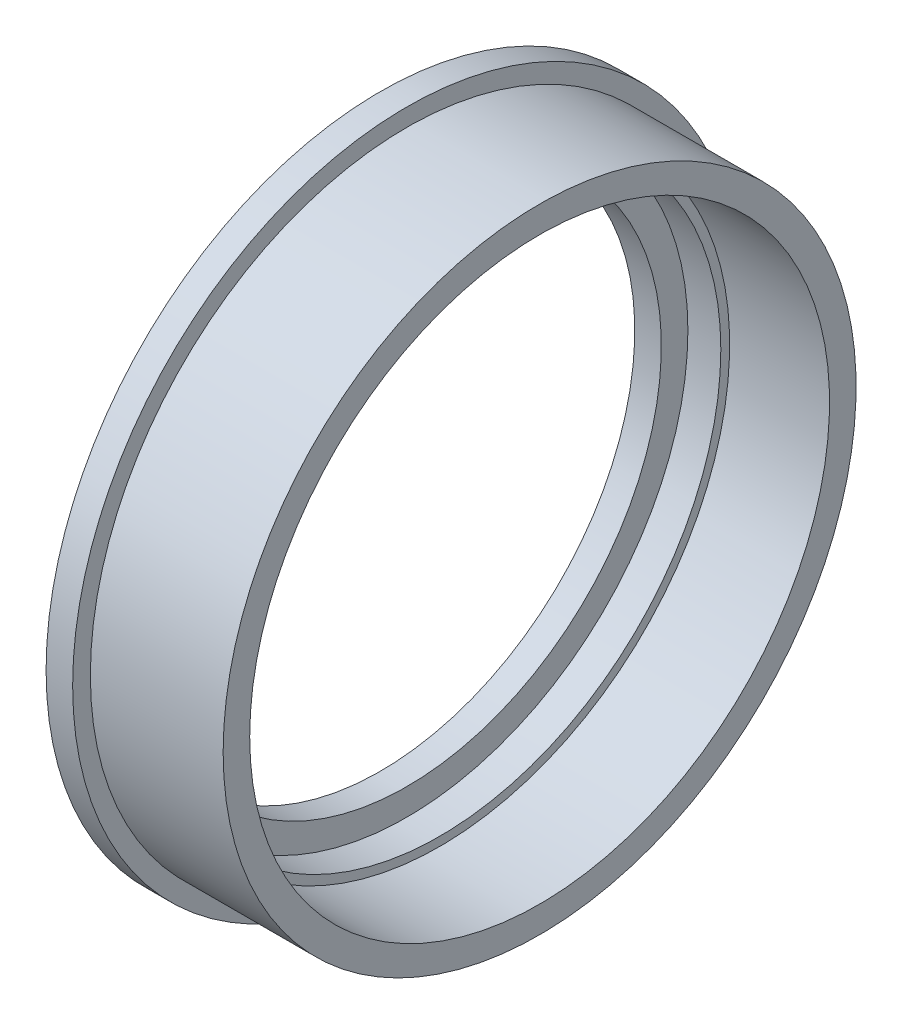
ISO-10303-21;
HEADER;
FILE_DESCRIPTION(('STEP AP214'),'2;1');
FILE_NAME('part.step','',(''),(''),'','','');
FILE_SCHEMA(('AUTOMOTIVE_DESIGN { 1 0 10303 214 1 1 1 1 }'));
ENDSEC;
DATA;
#1=APPLICATION_CONTEXT('core data for automotive mechanical design processes');
#2=APPLICATION_PROTOCOL_DEFINITION('international standard','automotive_design',2000,#1);
#3=PRODUCT_CONTEXT('',#1,'mechanical');
#4=PRODUCT('Part','Part','',(#3));
#5=PRODUCT_RELATED_PRODUCT_CATEGORY('part','',(#4));
#6=PRODUCT_DEFINITION_FORMATION('','',#4);
#7=PRODUCT_DEFINITION_CONTEXT('part definition',#1,'design');
#8=PRODUCT_DEFINITION('design','',#6,#7);
#9=PRODUCT_DEFINITION_SHAPE('','',#8);
#10=(LENGTH_UNIT() NAMED_UNIT(*) SI_UNIT(.MILLI.,.METRE.));
#11=(NAMED_UNIT(*) PLANE_ANGLE_UNIT() SI_UNIT($,.RADIAN.));
#12=(NAMED_UNIT(*) SI_UNIT($,.STERADIAN.) SOLID_ANGLE_UNIT());
#13=UNCERTAINTY_MEASURE_WITH_UNIT(LENGTH_MEASURE(1.E-05),#10,'distance_accuracy_value','');
#14=(GEOMETRIC_REPRESENTATION_CONTEXT(3) GLOBAL_UNCERTAINTY_ASSIGNED_CONTEXT((#13)) GLOBAL_UNIT_ASSIGNED_CONTEXT((#10,
#11,#12)) REPRESENTATION_CONTEXT('',''));
#15=CARTESIAN_POINT('',(0.,0.,0.));
#16=DIRECTION('',(0.,0.,1.));
#17=DIRECTION('',(1.,0.,0.));
#18=AXIS2_PLACEMENT_3D('',#15,#16,#17);
#19=CARTESIAN_POINT('',(0.,31.75,0.));
#20=DIRECTION('',(-1.,0.,0.));
#21=DIRECTION('',(0.,0.,1.));
#22=AXIS2_PLACEMENT_3D('',#19,#20,#21);
#23=PLANE('',#22);
#24=CARTESIAN_POINT('',(0.,0.,0.));
#25=DIRECTION('',(-1.,0.,0.));
#26=DIRECTION('',(0.,0.,1.));
#27=AXIS2_PLACEMENT_3D('',#24,#25,#26);
#28=CIRCLE('',#27,31.75);
#29=CARTESIAN_POINT('',(0.,0.,31.75));
#30=VERTEX_POINT('',#29);
#31=EDGE_CURVE('E62',#30,#30,#28,.T.);
#32=ORIENTED_EDGE('',*,*,#31,.F.);
#33=EDGE_LOOP('',(#32));
#34=FACE_BOUND('',#33,.T.);
#35=CARTESIAN_POINT('',(0.,0.,0.));
#36=DIRECTION('',(-1.,0.,0.));
#37=DIRECTION('',(0.,0.,1.));
#38=AXIS2_PLACEMENT_3D('',#35,#36,#37);
#39=CIRCLE('',#38,28.75);
#40=CARTESIAN_POINT('',(0.,0.,28.75));
#41=VERTEX_POINT('',#40);
#42=EDGE_CURVE('E10',#41,#41,#39,.T.);
#43=ORIENTED_EDGE('',*,*,#42,.T.);
#44=EDGE_LOOP('',(#43));
#45=FACE_BOUND('',#44,.T.);
#46=ADVANCED_FACE('F28',(#34,#45),#23,.F.);
#47=CARTESIAN_POINT('',(0.,0.,0.));
#48=DIRECTION('',(-1.,0.,0.));
#49=DIRECTION('',(0.,0.,1.));
#50=AXIS2_PLACEMENT_3D('',#47,#48,#49);
#51=CYLINDRICAL_SURFACE('',#50,28.75);
#52=ORIENTED_EDGE('',*,*,#42,.F.);
#53=EDGE_LOOP('',(#52));
#54=FACE_BOUND('',#53,.T.);
#55=CARTESIAN_POINT('',(-3.,0.,0.));
#56=DIRECTION('',(-1.,0.,0.));
#57=DIRECTION('',(0.,0.,1.));
#58=AXIS2_PLACEMENT_3D('',#55,#56,#57);
#59=CIRCLE('',#58,28.75);
#60=CARTESIAN_POINT('',(-3.,0.,28.75));
#61=VERTEX_POINT('',#60);
#62=EDGE_CURVE('E34',#61,#61,#59,.T.);
#63=ORIENTED_EDGE('',*,*,#62,.T.);
#64=EDGE_LOOP('',(#63));
#65=FACE_BOUND('',#64,.T.);
#66=ADVANCED_FACE('F69',(#54,#65),#51,.F.);
#67=CARTESIAN_POINT('',(-3.,28.75,0.));
#68=DIRECTION('',(1.,0.,0.));
#69=DIRECTION('',(0.,0.,-1.));
#70=AXIS2_PLACEMENT_3D('',#67,#68,#69);
#71=PLANE('',#70);
#72=ORIENTED_EDGE('',*,*,#62,.F.);
#73=EDGE_LOOP('',(#72));
#74=FACE_BOUND('',#73,.T.);
#75=CARTESIAN_POINT('',(-3.,0.,0.));
#76=DIRECTION('',(-1.,0.,0.));
#77=DIRECTION('',(0.,0.,1.));
#78=AXIS2_PLACEMENT_3D('',#75,#76,#77);
#79=CIRCLE('',#78,37.75);
#80=CARTESIAN_POINT('',(-3.,0.,37.75));
#81=VERTEX_POINT('',#80);
#82=EDGE_CURVE('E38',#81,#81,#79,.T.);
#83=ORIENTED_EDGE('',*,*,#82,.T.);
#84=EDGE_LOOP('',(#83));
#85=FACE_BOUND('',#84,.T.);
#86=ADVANCED_FACE('F73',(#74,#85),#71,.F.);
#87=CARTESIAN_POINT('',(0.,0.,0.));
#88=DIRECTION('',(-1.,0.,0.));
#89=DIRECTION('',(0.,0.,1.));
#90=AXIS2_PLACEMENT_3D('',#87,#88,#89);
#91=CYLINDRICAL_SURFACE('',#90,37.75);
#92=ORIENTED_EDGE('',*,*,#82,.F.);
#93=EDGE_LOOP('',(#92));
#94=FACE_BOUND('',#93,.T.);
#95=CARTESIAN_POINT('',(0.,0.,0.));
#96=DIRECTION('',(-1.,0.,0.));
#97=DIRECTION('',(0.,0.,1.));
#98=AXIS2_PLACEMENT_3D('',#95,#96,#97);
#99=CIRCLE('',#98,37.75);
#100=CARTESIAN_POINT('',(0.,0.,37.75));
#101=VERTEX_POINT('',#100);
#102=EDGE_CURVE('E42',#101,#101,#99,.T.);
#103=ORIENTED_EDGE('',*,*,#102,.T.);
#104=EDGE_LOOP('',(#103));
#105=FACE_BOUND('',#104,.T.);
#106=ADVANCED_FACE('F78',(#94,#105),#91,.T.);
#107=CARTESIAN_POINT('',(0.,37.75,0.));
#108=DIRECTION('',(-1.,0.,0.));
#109=DIRECTION('',(0.,0.,1.));
#110=AXIS2_PLACEMENT_3D('',#107,#108,#109);
#111=PLANE('',#110);
#112=ORIENTED_EDGE('',*,*,#102,.F.);
#113=EDGE_LOOP('',(#112));
#114=FACE_BOUND('',#113,.T.);
#115=CARTESIAN_POINT('',(0.,0.,0.));
#116=DIRECTION('',(-1.,0.,0.));
#117=DIRECTION('',(0.,0.,1.));
#118=AXIS2_PLACEMENT_3D('',#115,#116,#117);
#119=CIRCLE('',#118,35.75);
#120=CARTESIAN_POINT('',(0.,0.,35.75));
#121=VERTEX_POINT('',#120);
#122=EDGE_CURVE('E47',#121,#121,#119,.T.);
#123=ORIENTED_EDGE('',*,*,#122,.T.);
#124=EDGE_LOOP('',(#123));
#125=FACE_BOUND('',#124,.T.);
#126=ADVANCED_FACE('F84',(#114,#125),#111,.F.);
#127=CARTESIAN_POINT('',(0.,0.,0.));
#128=DIRECTION('',(-1.,0.,0.));
#129=DIRECTION('',(0.,0.,1.));
#130=AXIS2_PLACEMENT_3D('',#127,#128,#129);
#131=CYLINDRICAL_SURFACE('',#130,35.75);
#132=ORIENTED_EDGE('',*,*,#122,.F.);
#133=EDGE_LOOP('',(#132));
#134=FACE_BOUND('',#133,.T.);
#135=CARTESIAN_POINT('',(15.,0.,0.));
#136=DIRECTION('',(-1.,0.,0.));
#137=DIRECTION('',(0.,0.,1.));
#138=AXIS2_PLACEMENT_3D('',#135,#136,#137);
#139=CIRCLE('',#138,35.75);
#140=CARTESIAN_POINT('',(15.,0.,35.75));
#141=VERTEX_POINT('',#140);
#142=EDGE_CURVE('E50',#141,#141,#139,.T.);
#143=ORIENTED_EDGE('',*,*,#142,.T.);
#144=EDGE_LOOP('',(#143));
#145=FACE_BOUND('',#144,.T.);
#146=ADVANCED_FACE('F88',(#134,#145),#131,.T.);
#147=CARTESIAN_POINT('',(15.,35.75,0.));
#148=DIRECTION('',(-1.,0.,0.));
#149=DIRECTION('',(0.,0.,1.));
#150=AXIS2_PLACEMENT_3D('',#147,#148,#149);
#151=PLANE('',#150);
#152=ORIENTED_EDGE('',*,*,#142,.F.);
#153=EDGE_LOOP('',(#152));
#154=FACE_BOUND('',#153,.T.);
#155=CARTESIAN_POINT('',(15.,0.,0.));
#156=DIRECTION('',(-1.,0.,0.));
#157=DIRECTION('',(0.,0.,1.));
#158=AXIS2_PLACEMENT_3D('',#155,#156,#157);
#159=CIRCLE('',#158,32.75);
#160=CARTESIAN_POINT('',(15.,0.,32.75));
#161=VERTEX_POINT('',#160);
#162=EDGE_CURVE('E53',#161,#161,#159,.T.);
#163=ORIENTED_EDGE('',*,*,#162,.T.);
#164=EDGE_LOOP('',(#163));
#165=FACE_BOUND('',#164,.T.);
#166=ADVANCED_FACE('F92',(#154,#165),#151,.F.);
#167=CARTESIAN_POINT('',(0.,0.,0.));
#168=DIRECTION('',(-1.,0.,0.));
#169=DIRECTION('',(0.,0.,1.));
#170=AXIS2_PLACEMENT_3D('',#167,#168,#169);
#171=CYLINDRICAL_SURFACE('',#170,32.75);
#172=ORIENTED_EDGE('',*,*,#162,.F.);
#173=EDGE_LOOP('',(#172));
#174=FACE_BOUND('',#173,.T.);
#175=CARTESIAN_POINT('',(3.71854395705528,0.,0.));
#176=DIRECTION('',(-1.,0.,0.));
#177=DIRECTION('',(0.,0.,1.));
#178=AXIS2_PLACEMENT_3D('',#175,#176,#177);
#179=CIRCLE('',#178,32.75);
#180=CARTESIAN_POINT('',(3.71854395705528,0.,32.75));
#181=VERTEX_POINT('',#180);
#182=EDGE_CURVE('E56',#181,#181,#179,.T.);
#183=ORIENTED_EDGE('',*,*,#182,.T.);
#184=EDGE_LOOP('',(#183));
#185=FACE_BOUND('',#184,.T.);
#186=ADVANCED_FACE('F96',(#174,#185),#171,.F.);
#187=CARTESIAN_POINT('',(3.71854395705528,32.75,0.));
#188=DIRECTION('',(-1.,0.,0.));
#189=DIRECTION('',(0.,0.,1.));
#190=AXIS2_PLACEMENT_3D('',#187,#188,#189);
#191=PLANE('',#190);
#192=ORIENTED_EDGE('',*,*,#182,.F.);
#193=EDGE_LOOP('',(#192));
#194=FACE_BOUND('',#193,.T.);
#195=CARTESIAN_POINT('',(3.71854395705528,0.,0.));
#196=DIRECTION('',(-1.,0.,0.));
#197=DIRECTION('',(0.,0.,1.));
#198=AXIS2_PLACEMENT_3D('',#195,#196,#197);
#199=CIRCLE('',#198,31.75);
#200=CARTESIAN_POINT('',(3.71854395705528,0.,31.75));
#201=VERTEX_POINT('',#200);
#202=EDGE_CURVE('E59',#201,#201,#199,.T.);
#203=ORIENTED_EDGE('',*,*,#202,.T.);
#204=EDGE_LOOP('',(#203));
#205=FACE_BOUND('',#204,.T.);
#206=ADVANCED_FACE('F100',(#194,#205),#191,.F.);
#207=CARTESIAN_POINT('',(0.,0.,0.));
#208=DIRECTION('',(-1.,0.,0.));
#209=DIRECTION('',(0.,0.,1.));
#210=AXIS2_PLACEMENT_3D('',#207,#208,#209);
#211=CYLINDRICAL_SURFACE('',#210,31.75);
#212=ORIENTED_EDGE('',*,*,#202,.F.);
#213=EDGE_LOOP('',(#212));
#214=FACE_BOUND('',#213,.T.);
#215=ORIENTED_EDGE('',*,*,#31,.T.);
#216=EDGE_LOOP('',(#215));
#217=FACE_BOUND('',#216,.T.);
#218=ADVANCED_FACE('F66',(#214,#217),#211,.F.);
#219=CLOSED_SHELL('',(#46,#66,#86,#106,#126,#146,#166,#186,#206,#218));
#220=MANIFOLD_SOLID_BREP('B2',#219);
#221=ADVANCED_BREP_SHAPE_REPRESENTATION('',(#18,#220),#14);
#222=SHAPE_DEFINITION_REPRESENTATION(#9,#221);
ENDSEC;
END-ISO-10303-21;
